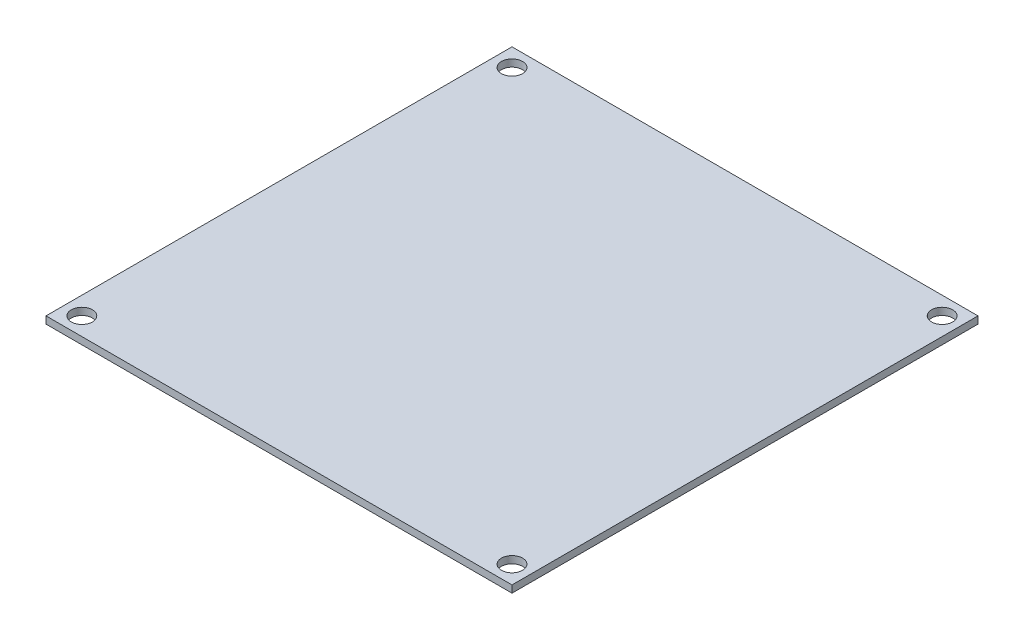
ISO-10303-21;
HEADER;
FILE_DESCRIPTION(('STEP AP214'),'2;1');
FILE_NAME('part.step','',(''),(''),'','','');
FILE_SCHEMA(('AUTOMOTIVE_DESIGN { 1 0 10303 214 1 1 1 1 }'));
ENDSEC;
DATA;
#1=APPLICATION_CONTEXT('core data for automotive mechanical design processes');
#2=APPLICATION_PROTOCOL_DEFINITION('international standard','automotive_design',2000,#1);
#3=PRODUCT_CONTEXT('',#1,'mechanical');
#4=PRODUCT('Part','Part','',(#3));
#5=PRODUCT_RELATED_PRODUCT_CATEGORY('part','',(#4));
#6=PRODUCT_DEFINITION_FORMATION('','',#4);
#7=PRODUCT_DEFINITION_CONTEXT('part definition',#1,'design');
#8=PRODUCT_DEFINITION('design','',#6,#7);
#9=PRODUCT_DEFINITION_SHAPE('','',#8);
#10=(LENGTH_UNIT() NAMED_UNIT(*) SI_UNIT(.MILLI.,.METRE.));
#11=(NAMED_UNIT(*) PLANE_ANGLE_UNIT() SI_UNIT($,.RADIAN.));
#12=(NAMED_UNIT(*) SI_UNIT($,.STERADIAN.) SOLID_ANGLE_UNIT());
#13=UNCERTAINTY_MEASURE_WITH_UNIT(LENGTH_MEASURE(1.E-05),#10,'distance_accuracy_value','');
#14=(GEOMETRIC_REPRESENTATION_CONTEXT(3) GLOBAL_UNCERTAINTY_ASSIGNED_CONTEXT((#13)) GLOBAL_UNIT_ASSIGNED_CONTEXT((#10,
#11,#12)) REPRESENTATION_CONTEXT('',''));
#15=CARTESIAN_POINT('',(0.,0.,0.));
#16=DIRECTION('',(0.,0.,1.));
#17=DIRECTION('',(1.,0.,0.));
#18=AXIS2_PLACEMENT_3D('',#15,#16,#17);
#19=CARTESIAN_POINT('',(0.,1.,0.));
#20=DIRECTION('',(1.,0.,0.));
#21=DIRECTION('',(0.,0.,-1.));
#22=AXIS2_PLACEMENT_3D('',#19,#20,#21);
#23=PLANE('',#22);
#24=DIRECTION('',(0.,0.,1.));
#25=VECTOR('',#24,1.);
#26=CARTESIAN_POINT('',(0.,0.,0.));
#27=LINE('',#26,#25);
#28=CARTESIAN_POINT('',(0.,0.,-65.));
#29=VERTEX_POINT('',#28);
#30=CARTESIAN_POINT('',(0.,0.,0.));
#31=VERTEX_POINT('',#30);
#32=EDGE_CURVE('E96',#29,#31,#27,.T.);
#33=ORIENTED_EDGE('',*,*,#32,.T.);
#34=DIRECTION('',(0.,-1.,0.));
#35=VECTOR('',#34,1.);
#36=CARTESIAN_POINT('',(0.,1.,0.));
#37=LINE('',#36,#35);
#38=CARTESIAN_POINT('',(0.,1.,0.));
#39=VERTEX_POINT('',#38);
#40=EDGE_CURVE('E11',#39,#31,#37,.T.);
#41=ORIENTED_EDGE('',*,*,#40,.F.);
#42=DIRECTION('',(0.,0.,1.));
#43=VECTOR('',#42,1.);
#44=CARTESIAN_POINT('',(0.,1.,0.));
#45=LINE('',#44,#43);
#46=CARTESIAN_POINT('',(0.,1.,-65.));
#47=VERTEX_POINT('',#46);
#48=EDGE_CURVE('E84',#47,#39,#45,.T.);
#49=ORIENTED_EDGE('',*,*,#48,.F.);
#50=DIRECTION('',(0.,-1.,0.));
#51=VECTOR('',#50,1.);
#52=CARTESIAN_POINT('',(0.,1.,-65.));
#53=LINE('',#52,#51);
#54=EDGE_CURVE('E92',#47,#29,#53,.T.);
#55=ORIENTED_EDGE('',*,*,#54,.T.);
#56=EDGE_LOOP('',(#33,#41,#49,#55));
#57=FACE_BOUND('',#56,.T.);
#58=ADVANCED_FACE('F33',(#57),#23,.F.);
#59=CARTESIAN_POINT('',(0.,1.,0.));
#60=DIRECTION('',(0.,0.,-1.));
#61=DIRECTION('',(-1.,0.,0.));
#62=AXIS2_PLACEMENT_3D('',#59,#60,#61);
#63=PLANE('',#62);
#64=DIRECTION('',(1.,0.,0.));
#65=VECTOR('',#64,1.);
#66=CARTESIAN_POINT('',(0.,0.,0.));
#67=LINE('',#66,#65);
#68=CARTESIAN_POINT('',(65.,0.,0.));
#69=VERTEX_POINT('',#68);
#70=EDGE_CURVE('E88',#31,#69,#67,.T.);
#71=ORIENTED_EDGE('',*,*,#70,.T.);
#72=DIRECTION('',(0.,-1.,0.));
#73=VECTOR('',#72,1.);
#74=CARTESIAN_POINT('',(65.,1.,0.));
#75=LINE('',#74,#73);
#76=CARTESIAN_POINT('',(65.,1.,0.));
#77=VERTEX_POINT('',#76);
#78=EDGE_CURVE('E41',#77,#69,#75,.T.);
#79=ORIENTED_EDGE('',*,*,#78,.F.);
#80=DIRECTION('',(1.,0.,0.));
#81=VECTOR('',#80,1.);
#82=CARTESIAN_POINT('',(0.,1.,0.));
#83=LINE('',#82,#81);
#84=EDGE_CURVE('E79',#39,#77,#83,.T.);
#85=ORIENTED_EDGE('',*,*,#84,.F.);
#86=ORIENTED_EDGE('',*,*,#40,.T.);
#87=EDGE_LOOP('',(#71,#79,#85,#86));
#88=FACE_BOUND('',#87,.T.);
#89=ADVANCED_FACE('F87',(#88),#63,.F.);
#90=CARTESIAN_POINT('',(65.,1.,0.));
#91=DIRECTION('',(-1.,0.,0.));
#92=DIRECTION('',(0.,0.,1.));
#93=AXIS2_PLACEMENT_3D('',#90,#91,#92);
#94=PLANE('',#93);
#95=DIRECTION('',(0.,0.,-1.));
#96=VECTOR('',#95,1.);
#97=CARTESIAN_POINT('',(65.,0.,0.));
#98=LINE('',#97,#96);
#99=CARTESIAN_POINT('',(65.,0.,-65.));
#100=VERTEX_POINT('',#99);
#101=EDGE_CURVE('E66',#69,#100,#98,.T.);
#102=ORIENTED_EDGE('',*,*,#101,.T.);
#103=DIRECTION('',(0.,-1.,0.));
#104=VECTOR('',#103,1.);
#105=CARTESIAN_POINT('',(65.,1.,-65.));
#106=LINE('',#105,#104);
#107=CARTESIAN_POINT('',(65.,1.,-65.));
#108=VERTEX_POINT('',#107);
#109=EDGE_CURVE('E89',#108,#100,#106,.T.);
#110=ORIENTED_EDGE('',*,*,#109,.F.);
#111=DIRECTION('',(0.,0.,-1.));
#112=VECTOR('',#111,1.);
#113=CARTESIAN_POINT('',(65.,1.,0.));
#114=LINE('',#113,#112);
#115=EDGE_CURVE('E82',#77,#108,#114,.T.);
#116=ORIENTED_EDGE('',*,*,#115,.F.);
#117=ORIENTED_EDGE('',*,*,#78,.T.);
#118=EDGE_LOOP('',(#102,#110,#116,#117));
#119=FACE_BOUND('',#118,.T.);
#120=ADVANCED_FACE('F90',(#119),#94,.F.);
#121=CARTESIAN_POINT('',(0.,1.,-65.));
#122=DIRECTION('',(0.,0.,1.));
#123=DIRECTION('',(1.,0.,0.));
#124=AXIS2_PLACEMENT_3D('',#121,#122,#123);
#125=PLANE('',#124);
#126=DIRECTION('',(-1.,0.,0.));
#127=VECTOR('',#126,1.);
#128=CARTESIAN_POINT('',(0.,0.,-65.));
#129=LINE('',#128,#127);
#130=EDGE_CURVE('E72',#100,#29,#129,.T.);
#131=ORIENTED_EDGE('',*,*,#130,.T.);
#132=ORIENTED_EDGE('',*,*,#54,.F.);
#133=DIRECTION('',(-1.,0.,0.));
#134=VECTOR('',#133,1.);
#135=CARTESIAN_POINT('',(0.,1.,-65.));
#136=LINE('',#135,#134);
#137=EDGE_CURVE('E49',#108,#47,#136,.T.);
#138=ORIENTED_EDGE('',*,*,#137,.F.);
#139=ORIENTED_EDGE('',*,*,#109,.T.);
#140=EDGE_LOOP('',(#131,#132,#138,#139));
#141=FACE_BOUND('',#140,.T.);
#142=ADVANCED_FACE('F104',(#141),#125,.F.);
#143=CARTESIAN_POINT('',(0.,1.,0.));
#144=DIRECTION('',(0.,-1.,0.));
#145=DIRECTION('',(0.,0.,-1.));
#146=AXIS2_PLACEMENT_3D('',#143,#144,#145);
#147=PLANE('',#146);
#148=CARTESIAN_POINT('',(2.49999999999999,1.,-62.5));
#149=DIRECTION('',(0.,1.,0.));
#150=DIRECTION('',(0.,0.,1.));
#151=AXIS2_PLACEMENT_3D('',#148,#149,#150);
#152=CIRCLE('',#151,1.4732);
#153=CARTESIAN_POINT('',(2.49999999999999,1.,-61.0268));
#154=VERTEX_POINT('',#153);
#155=EDGE_CURVE('E130',#154,#154,#152,.T.);
#156=ORIENTED_EDGE('',*,*,#155,.F.);
#157=EDGE_LOOP('',(#156));
#158=FACE_BOUND('',#157,.T.);
#159=CARTESIAN_POINT('',(62.5,1.,-62.5));
#160=DIRECTION('',(0.,1.,0.));
#161=DIRECTION('',(0.,0.,1.));
#162=AXIS2_PLACEMENT_3D('',#159,#160,#161);
#163=CIRCLE('',#162,1.47319999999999);
#164=CARTESIAN_POINT('',(62.5,1.,-61.0268));
#165=VERTEX_POINT('',#164);
#166=EDGE_CURVE('E124',#165,#165,#163,.T.);
#167=ORIENTED_EDGE('',*,*,#166,.F.);
#168=EDGE_LOOP('',(#167));
#169=FACE_BOUND('',#168,.T.);
#170=CARTESIAN_POINT('',(62.5,1.,-2.50000000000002));
#171=DIRECTION('',(0.,1.,0.));
#172=DIRECTION('',(0.,0.,1.));
#173=AXIS2_PLACEMENT_3D('',#170,#171,#172);
#174=CIRCLE('',#173,1.47319999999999);
#175=CARTESIAN_POINT('',(62.5,1.,-1.02680000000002));
#176=VERTEX_POINT('',#175);
#177=EDGE_CURVE('E118',#176,#176,#174,.T.);
#178=ORIENTED_EDGE('',*,*,#177,.F.);
#179=EDGE_LOOP('',(#178));
#180=FACE_BOUND('',#179,.T.);
#181=CARTESIAN_POINT('',(2.5,1.,-2.5));
#182=DIRECTION('',(0.,1.,0.));
#183=DIRECTION('',(0.,0.,1.));
#184=AXIS2_PLACEMENT_3D('',#181,#182,#183);
#185=CIRCLE('',#184,1.4732);
#186=CARTESIAN_POINT('',(2.5,1.,-1.0268));
#187=VERTEX_POINT('',#186);
#188=EDGE_CURVE('E112',#187,#187,#185,.T.);
#189=ORIENTED_EDGE('',*,*,#188,.F.);
#190=EDGE_LOOP('',(#189));
#191=FACE_BOUND('',#190,.T.);
#192=ORIENTED_EDGE('',*,*,#48,.T.);
#193=ORIENTED_EDGE('',*,*,#84,.T.);
#194=ORIENTED_EDGE('',*,*,#115,.T.);
#195=ORIENTED_EDGE('',*,*,#137,.T.);
#196=EDGE_LOOP('',(#192,#193,#194,#195));
#197=FACE_BOUND('',#196,.T.);
#198=ADVANCED_FACE('F80',(#158,#169,#180,#191,#197),#147,.F.);
#199=CARTESIAN_POINT('',(0.,0.,0.));
#200=DIRECTION('',(0.,-1.,0.));
#201=DIRECTION('',(0.,0.,-1.));
#202=AXIS2_PLACEMENT_3D('',#199,#200,#201);
#203=PLANE('',#202);
#204=CARTESIAN_POINT('',(2.49999999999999,0.,-62.5));
#205=DIRECTION('',(0.,1.,0.));
#206=DIRECTION('',(0.,0.,1.));
#207=AXIS2_PLACEMENT_3D('',#204,#205,#206);
#208=CIRCLE('',#207,1.4732);
#209=CARTESIAN_POINT('',(2.49999999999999,0.,-61.0268));
#210=VERTEX_POINT('',#209);
#211=EDGE_CURVE('E127',#210,#210,#208,.T.);
#212=ORIENTED_EDGE('',*,*,#211,.T.);
#213=EDGE_LOOP('',(#212));
#214=FACE_BOUND('',#213,.T.);
#215=CARTESIAN_POINT('',(62.5,0.,-62.5));
#216=DIRECTION('',(0.,1.,0.));
#217=DIRECTION('',(0.,0.,1.));
#218=AXIS2_PLACEMENT_3D('',#215,#216,#217);
#219=CIRCLE('',#218,1.47319999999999);
#220=CARTESIAN_POINT('',(62.5,0.,-61.0268));
#221=VERTEX_POINT('',#220);
#222=EDGE_CURVE('E121',#221,#221,#219,.T.);
#223=ORIENTED_EDGE('',*,*,#222,.T.);
#224=EDGE_LOOP('',(#223));
#225=FACE_BOUND('',#224,.T.);
#226=CARTESIAN_POINT('',(62.5,0.,-2.50000000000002));
#227=DIRECTION('',(0.,1.,0.));
#228=DIRECTION('',(0.,0.,1.));
#229=AXIS2_PLACEMENT_3D('',#226,#227,#228);
#230=CIRCLE('',#229,1.47319999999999);
#231=CARTESIAN_POINT('',(62.5,0.,-1.02680000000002));
#232=VERTEX_POINT('',#231);
#233=EDGE_CURVE('E115',#232,#232,#230,.T.);
#234=ORIENTED_EDGE('',*,*,#233,.T.);
#235=EDGE_LOOP('',(#234));
#236=FACE_BOUND('',#235,.T.);
#237=CARTESIAN_POINT('',(2.5,0.,-2.5));
#238=DIRECTION('',(0.,1.,0.));
#239=DIRECTION('',(0.,0.,1.));
#240=AXIS2_PLACEMENT_3D('',#237,#238,#239);
#241=CIRCLE('',#240,1.4732);
#242=CARTESIAN_POINT('',(2.5,0.,-1.0268));
#243=VERTEX_POINT('',#242);
#244=EDGE_CURVE('E99',#243,#243,#241,.T.);
#245=ORIENTED_EDGE('',*,*,#244,.T.);
#246=EDGE_LOOP('',(#245));
#247=FACE_BOUND('',#246,.T.);
#248=ORIENTED_EDGE('',*,*,#32,.F.);
#249=ORIENTED_EDGE('',*,*,#130,.F.);
#250=ORIENTED_EDGE('',*,*,#101,.F.);
#251=ORIENTED_EDGE('',*,*,#70,.F.);
#252=EDGE_LOOP('',(#248,#249,#250,#251));
#253=FACE_BOUND('',#252,.T.);
#254=ADVANCED_FACE('F107',(#214,#225,#236,#247,#253),#203,.T.);
#255=CARTESIAN_POINT('',(2.5,1.,-2.5));
#256=DIRECTION('',(0.,1.,0.));
#257=DIRECTION('',(0.,0.,1.));
#258=AXIS2_PLACEMENT_3D('',#255,#256,#257);
#259=CYLINDRICAL_SURFACE('',#258,1.4732);
#260=ORIENTED_EDGE('',*,*,#244,.F.);
#261=EDGE_LOOP('',(#260));
#262=FACE_BOUND('',#261,.T.);
#263=ORIENTED_EDGE('',*,*,#188,.T.);
#264=EDGE_LOOP('',(#263));
#265=FACE_BOUND('',#264,.T.);
#266=ADVANCED_FACE('F145',(#262,#265),#259,.F.);
#267=CARTESIAN_POINT('',(62.5,1.,-2.50000000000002));
#268=DIRECTION('',(0.,1.,0.));
#269=DIRECTION('',(0.,0.,1.));
#270=AXIS2_PLACEMENT_3D('',#267,#268,#269);
#271=CYLINDRICAL_SURFACE('',#270,1.47319999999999);
#272=ORIENTED_EDGE('',*,*,#233,.F.);
#273=EDGE_LOOP('',(#272));
#274=FACE_BOUND('',#273,.T.);
#275=ORIENTED_EDGE('',*,*,#177,.T.);
#276=EDGE_LOOP('',(#275));
#277=FACE_BOUND('',#276,.T.);
#278=ADVANCED_FACE('F147',(#274,#277),#271,.F.);
#279=CARTESIAN_POINT('',(62.5,1.,-62.5));
#280=DIRECTION('',(0.,1.,0.));
#281=DIRECTION('',(0.,0.,1.));
#282=AXIS2_PLACEMENT_3D('',#279,#280,#281);
#283=CYLINDRICAL_SURFACE('',#282,1.47319999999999);
#284=ORIENTED_EDGE('',*,*,#222,.F.);
#285=EDGE_LOOP('',(#284));
#286=FACE_BOUND('',#285,.T.);
#287=ORIENTED_EDGE('',*,*,#166,.T.);
#288=EDGE_LOOP('',(#287));
#289=FACE_BOUND('',#288,.T.);
#290=ADVANCED_FACE('F154',(#286,#289),#283,.F.);
#291=CARTESIAN_POINT('',(2.49999999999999,1.,-62.5));
#292=DIRECTION('',(0.,1.,0.));
#293=DIRECTION('',(0.,0.,1.));
#294=AXIS2_PLACEMENT_3D('',#291,#292,#293);
#295=CYLINDRICAL_SURFACE('',#294,1.4732);
#296=ORIENTED_EDGE('',*,*,#211,.F.);
#297=EDGE_LOOP('',(#296));
#298=FACE_BOUND('',#297,.T.);
#299=ORIENTED_EDGE('',*,*,#155,.T.);
#300=EDGE_LOOP('',(#299));
#301=FACE_BOUND('',#300,.T.);
#302=ADVANCED_FACE('F134',(#298,#301),#295,.F.);
#303=CLOSED_SHELL('',(#58,#89,#120,#142,#198,#254,#266,#278,#290,#302));
#304=MANIFOLD_SOLID_BREP('B2',#303);
#305=ADVANCED_BREP_SHAPE_REPRESENTATION('',(#18,#304),#14);
#306=SHAPE_DEFINITION_REPRESENTATION(#9,#305);
ENDSEC;
END-ISO-10303-21;
